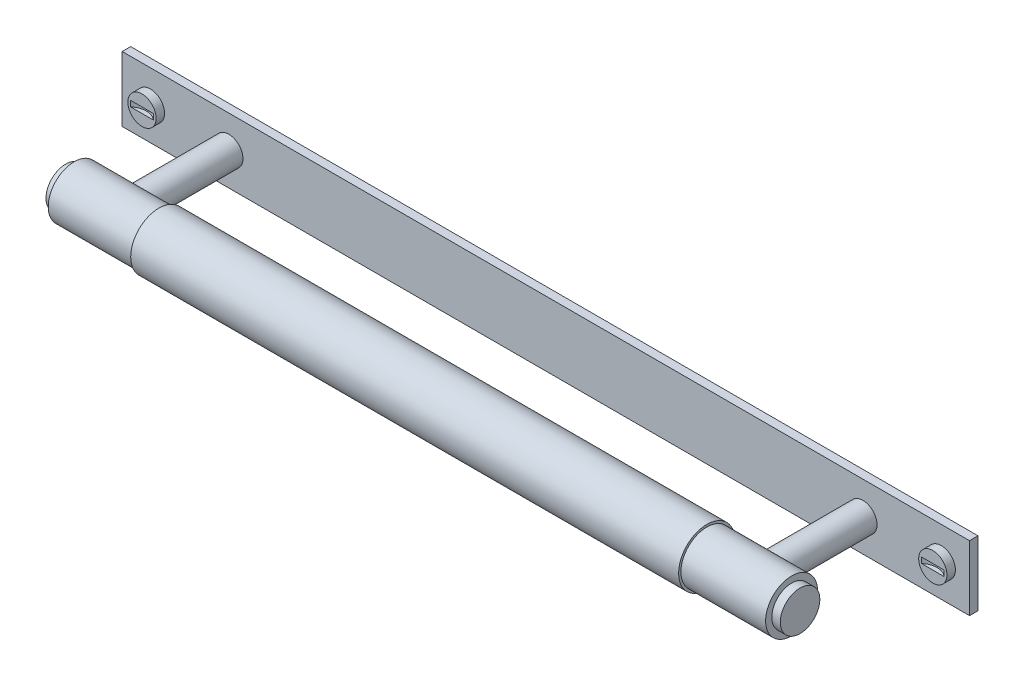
from build123d import *

# Parameters (mm, degrees)
SKETCH1_R           = 10
BOSS_EXTRUDE1_DEPTH = 97
SKETCH2_R           = 9.2
BOSS_EXTRUDE3_DEPTH = 30
SKETCH3_R           = 7
BOSS_EXTRUDE4_DEPTH = 3
SKETCH4_R           = 5
BOSS_EXTRUDE5_DEPTH = 40
SKETCH9_W           = 3
SKETCH9_H           = 23
BOSS_EXTRUDE8_DEPTH = 150
SKETCH10_R          = 5
BOSS_EXTRUDE9_DEPTH = 3
CUT_EXTRUDE1_DEPTH  = 1


with BuildPart() as part:
    # Sketch1 → Boss-Extrude1 (new body)
    with BuildSketch(Plane(origin=(0, 0, 0), x_dir=(0, 0, -1), z_dir=(1, 0, 0))):
        with Locations(Location((0, 0, 0), (0, 0, 180))):
            Circle(SKETCH1_R)
    boss_extrude1 = extrude(amount=BOSS_EXTRUDE1_DEPTH)

    # Sketch2 → Boss-Extrude3 (add)
    with BuildSketch(Plane(origin=(97, 0, 0), x_dir=(0, 0, -1), z_dir=(1, 0, 0))):
        Circle(SKETCH2_R)
    boss_extrude3 = extrude(amount=BOSS_EXTRUDE3_DEPTH)

    # Sketch3 → Boss-Extrude4 (add)
    with BuildSketch(Plane(origin=(127, 0, 0), x_dir=(0, 0, -1), z_dir=(1, 0, 0))):
        Circle(SKETCH3_R)
    boss_extrude4 = extrude(amount=BOSS_EXTRUDE4_DEPTH)

    # Mirror1: Boss-Extrude1, Boss-Extrude3, Boss-Extrude4 across plane
    add(boss_extrude1.mirror(Plane(origin=(0, 0, 0), x_dir=(0, 0, 1), z_dir=(1, 0, 0))))
    add(boss_extrude3.mirror(Plane(origin=(0, 0, 0), x_dir=(0, 0, 1), z_dir=(1, 0, 0))))
    add(boss_extrude4.mirror(Plane(origin=(0, 0, 0), x_dir=(0, 0, 1), z_dir=(1, 0, 0))))

    # Sketch4 → Boss-Extrude5 (add)
    with BuildSketch(Plane.XY):
        with Locations((-112.25, 0)):
            Circle(SKETCH4_R)
    boss_extrude5 = extrude(amount=-BOSS_EXTRUDE5_DEPTH)

    # Mirror2: Boss-Extrude5 across plane
    add(boss_extrude5.mirror(Plane(origin=(0, 0, 0), x_dir=(0, 0, 1), z_dir=(1, 0, 0))))

    # Sketch9 → Boss-Extrude8 (add, symmetric)
    with BuildSketch(Plane(origin=(0, 0, 0), x_dir=(0, 0, -1), z_dir=(1, 0, 0))):
        with Locations((41.5, 0)):
            Rectangle(SKETCH9_W, SKETCH9_H)
    extrude(amount=BOSS_EXTRUDE8_DEPTH, both=True)

    # Sketch10 → Boss-Extrude9 (add)
    with BuildSketch(Plane.XY.offset(-40)):
        with Locations(Location((140, 0, 0), (0, 0, 180))):
            Circle(SKETCH10_R)
    boss_extrude9 = extrude(amount=BOSS_EXTRUDE9_DEPTH)

    # Sketch11 → Cut-Extrude1 (cut, symmetric)
    with BuildSketch(Plane(origin=(0, 0, 0), x_dir=(1, 0, 0), z_dir=(0, 1, 0))):
        with BuildLine():
            Line((136, 37), (136, 34.634603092))
            Line((136, 34.634603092), (144, 34.634603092))
            Line((144, 34.634603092), (144, 37))
            ThreePointArc((144, 37), (140, 38.527864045), (136, 37))
        make_face()
    cut_extrude1 = extrude(amount=CUT_EXTRUDE1_DEPTH, both=True, mode=Mode.SUBTRACT)

    # Mirror3: Boss-Extrude9, Cut-Extrude1 across plane
    add(boss_extrude9.mirror(Plane(origin=(0, 0, 0), x_dir=(0, 0, 1), z_dir=(1, 0, 0))))
    add(cut_extrude1.mirror(Plane(origin=(0, 0, 0), x_dir=(0, 0, 1), z_dir=(1, 0, 0))), mode=Mode.SUBTRACT)


solid = part.part
